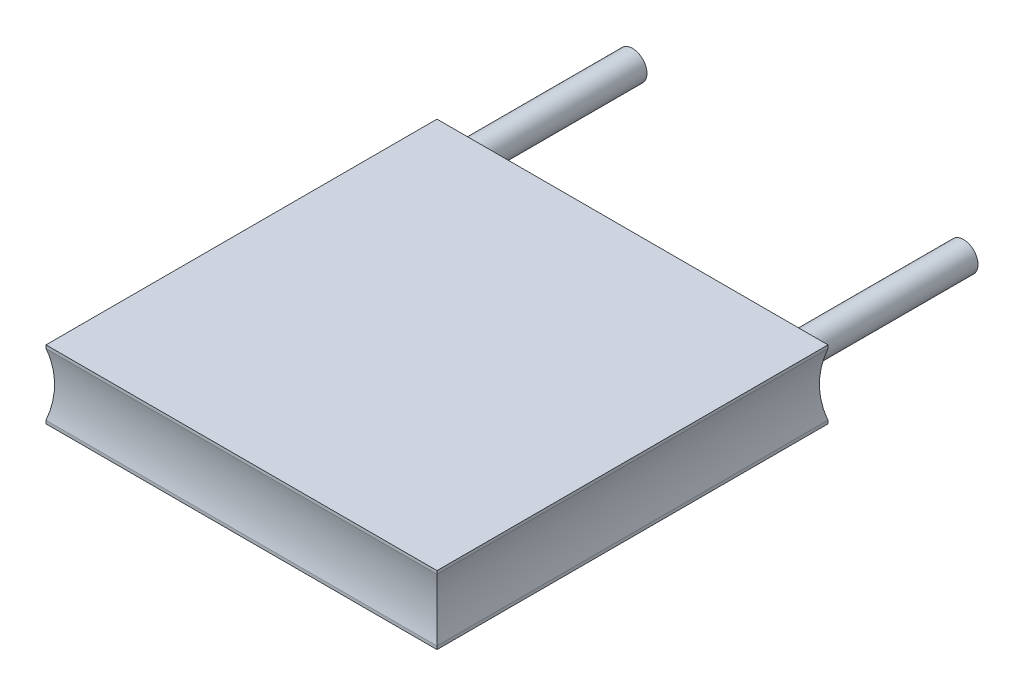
ISO-10303-21;
HEADER;
FILE_DESCRIPTION(('STEP AP214'),'2;1');
FILE_NAME('part.step','',(''),(''),'','','');
FILE_SCHEMA(('AUTOMOTIVE_DESIGN { 1 0 10303 214 1 1 1 1 }'));
ENDSEC;
DATA;
#1=APPLICATION_CONTEXT('core data for automotive mechanical design processes');
#2=APPLICATION_PROTOCOL_DEFINITION('international standard','automotive_design',2000,#1);
#3=PRODUCT_CONTEXT('',#1,'mechanical');
#4=PRODUCT('Part','Part','',(#3));
#5=PRODUCT_RELATED_PRODUCT_CATEGORY('part','',(#4));
#6=PRODUCT_DEFINITION_FORMATION('','',#4);
#7=PRODUCT_DEFINITION_CONTEXT('part definition',#1,'design');
#8=PRODUCT_DEFINITION('design','',#6,#7);
#9=PRODUCT_DEFINITION_SHAPE('','',#8);
#10=(LENGTH_UNIT() NAMED_UNIT(*) SI_UNIT(.MILLI.,.METRE.));
#11=(NAMED_UNIT(*) PLANE_ANGLE_UNIT() SI_UNIT($,.RADIAN.));
#12=(NAMED_UNIT(*) SI_UNIT($,.STERADIAN.) SOLID_ANGLE_UNIT());
#13=UNCERTAINTY_MEASURE_WITH_UNIT(LENGTH_MEASURE(1.E-05),#10,'distance_accuracy_value','');
#14=(GEOMETRIC_REPRESENTATION_CONTEXT(3) GLOBAL_UNCERTAINTY_ASSIGNED_CONTEXT((#13)) GLOBAL_UNIT_ASSIGNED_CONTEXT((#10,
#11,#12)) REPRESENTATION_CONTEXT('',''));
#15=CARTESIAN_POINT('',(0.,0.,0.));
#16=DIRECTION('',(0.,0.,1.));
#17=DIRECTION('',(1.,0.,0.));
#18=AXIS2_PLACEMENT_3D('',#15,#16,#17);
#19=CARTESIAN_POINT('',(-12.7,1.016,-27.7));
#20=DIRECTION('',(0.,0.,1.));
#21=DIRECTION('',(1.,0.,0.));
#22=AXIS2_PLACEMENT_3D('',#19,#20,#21);
#23=CYLINDRICAL_SURFACE('',#22,1.11125);
#24=CARTESIAN_POINT('',(-12.7,1.016,-27.7));
#25=DIRECTION('',(0.,0.,-1.));
#26=DIRECTION('',(-1.,0.,0.));
#27=AXIS2_PLACEMENT_3D('',#24,#25,#26);
#28=CIRCLE('',#27,1.11125);
#29=CARTESIAN_POINT('',(-13.81125,1.016,-27.7));
#30=VERTEX_POINT('',#29);
#31=EDGE_CURVE('E11',#30,#30,#28,.T.);
#32=ORIENTED_EDGE('',*,*,#31,.F.);
#33=EDGE_LOOP('',(#32));
#34=FACE_BOUND('',#33,.T.);
#35=CARTESIAN_POINT('',(-12.7,1.016,-15.));
#36=DIRECTION('',(0.,0.,-1.));
#37=DIRECTION('',(-1.,0.,0.));
#38=AXIS2_PLACEMENT_3D('',#35,#36,#37);
#39=CIRCLE('',#38,1.11125);
#40=CARTESIAN_POINT('',(-13.81125,1.016,-15.));
#41=VERTEX_POINT('',#40);
#42=EDGE_CURVE('E45',#41,#41,#39,.T.);
#43=ORIENTED_EDGE('',*,*,#42,.T.);
#44=EDGE_LOOP('',(#43));
#45=FACE_BOUND('',#44,.T.);
#46=ADVANCED_FACE('F42',(#34,#45),#23,.T.);
#47=CARTESIAN_POINT('',(-12.7,1.016,-27.7));
#48=DIRECTION('',(0.,0.,-1.));
#49=DIRECTION('',(-1.,0.,0.));
#50=AXIS2_PLACEMENT_3D('',#47,#48,#49);
#51=PLANE('',#50);
#52=ORIENTED_EDGE('',*,*,#31,.T.);
#53=EDGE_LOOP('',(#52));
#54=FACE_BOUND('',#53,.T.);
#55=ADVANCED_FACE('F57',(#54),#51,.T.);
#56=CARTESIAN_POINT('',(-12.7,1.016,-15.));
#57=DIRECTION('',(0.,0.,-1.));
#58=DIRECTION('',(-1.,0.,0.));
#59=AXIS2_PLACEMENT_3D('',#56,#57,#58);
#60=PLANE('',#59);
#61=ORIENTED_EDGE('',*,*,#42,.F.);
#62=EDGE_LOOP('',(#61));
#63=FACE_BOUND('',#62,.T.);
#64=ADVANCED_FACE('F55',(#63),#60,.F.);
#65=CLOSED_SHELL('',(#46,#55,#64));
#66=MANIFOLD_SOLID_BREP('B2',#65);
#67=CARTESIAN_POINT('',(12.7,1.016,-27.7));
#68=DIRECTION('',(0.,0.,1.));
#69=DIRECTION('',(1.,0.,0.));
#70=AXIS2_PLACEMENT_3D('',#67,#68,#69);
#71=CYLINDRICAL_SURFACE('',#70,1.11125);
#72=CARTESIAN_POINT('',(12.7,1.016,-27.7));
#73=DIRECTION('',(0.,0.,-1.));
#74=DIRECTION('',(-1.,0.,0.));
#75=AXIS2_PLACEMENT_3D('',#72,#73,#74);
#76=CIRCLE('',#75,1.11125);
#77=CARTESIAN_POINT('',(11.58875,1.016,-27.7));
#78=VERTEX_POINT('',#77);
#79=EDGE_CURVE('E41',#78,#78,#76,.T.);
#80=ORIENTED_EDGE('',*,*,#79,.F.);
#81=EDGE_LOOP('',(#80));
#82=FACE_BOUND('',#81,.T.);
#83=CARTESIAN_POINT('',(12.7,1.016,-15.));
#84=DIRECTION('',(0.,0.,-1.));
#85=DIRECTION('',(-1.,0.,0.));
#86=AXIS2_PLACEMENT_3D('',#83,#84,#85);
#87=CIRCLE('',#86,1.11125);
#88=CARTESIAN_POINT('',(11.58875,1.016,-15.));
#89=VERTEX_POINT('',#88);
#90=EDGE_CURVE('E99',#89,#89,#87,.T.);
#91=ORIENTED_EDGE('',*,*,#90,.T.);
#92=EDGE_LOOP('',(#91));
#93=FACE_BOUND('',#92,.T.);
#94=ADVANCED_FACE('F96',(#82,#93),#71,.T.);
#95=CARTESIAN_POINT('',(12.7,1.016,-27.7));
#96=DIRECTION('',(0.,0.,-1.));
#97=DIRECTION('',(-1.,0.,0.));
#98=AXIS2_PLACEMENT_3D('',#95,#96,#97);
#99=PLANE('',#98);
#100=ORIENTED_EDGE('',*,*,#79,.T.);
#101=EDGE_LOOP('',(#100));
#102=FACE_BOUND('',#101,.T.);
#103=ADVANCED_FACE('F111',(#102),#99,.T.);
#104=CARTESIAN_POINT('',(12.7,1.016,-15.));
#105=DIRECTION('',(0.,0.,-1.));
#106=DIRECTION('',(-1.,0.,0.));
#107=AXIS2_PLACEMENT_3D('',#104,#105,#106);
#108=PLANE('',#107);
#109=ORIENTED_EDGE('',*,*,#90,.F.);
#110=EDGE_LOOP('',(#109));
#111=FACE_BOUND('',#110,.T.);
#112=ADVANCED_FACE('F109',(#111),#108,.F.);
#113=CLOSED_SHELL('',(#94,#103,#112));
#114=MANIFOLD_SOLID_BREP('B6',#113);
#115=CARTESIAN_POINT('',(-15.,2.625,15.));
#116=DIRECTION('',(0.,0.,-1.));
#117=DIRECTION('',(-1.,0.,0.));
#118=AXIS2_PLACEMENT_3D('',#115,#116,#117);
#119=PLANE('',#118);
#120=DIRECTION('',(0.,-1.,0.));
#121=VECTOR('',#120,1.);
#122=CARTESIAN_POINT('',(15.,2.625,15.));
#123=LINE('',#122,#121);
#124=CARTESIAN_POINT('',(15.,-2.38125,15.));
#125=VERTEX_POINT('',#124);
#126=CARTESIAN_POINT('',(15.,-2.625,15.));
#127=VERTEX_POINT('',#126);
#128=EDGE_CURVE('E184',#125,#127,#123,.T.);
#129=ORIENTED_EDGE('',*,*,#128,.F.);
#130=DIRECTION('',(-1.,0.,0.));
#131=VECTOR('',#130,1.);
#132=CARTESIAN_POINT('',(15.,-2.38125000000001,15.));
#133=LINE('',#132,#131);
#134=CARTESIAN_POINT('',(-15.,-2.38125000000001,15.));
#135=VERTEX_POINT('',#134);
#136=EDGE_CURVE('E220',#125,#135,#133,.T.);
#137=ORIENTED_EDGE('',*,*,#136,.T.);
#138=DIRECTION('',(0.,-1.,0.));
#139=VECTOR('',#138,1.);
#140=CARTESIAN_POINT('',(-15.,2.625,15.));
#141=LINE('',#140,#139);
#142=CARTESIAN_POINT('',(-15.,-2.625,15.));
#143=VERTEX_POINT('',#142);
#144=EDGE_CURVE('E176',#135,#143,#141,.T.);
#145=ORIENTED_EDGE('',*,*,#144,.T.);
#146=DIRECTION('',(1.,0.,0.));
#147=VECTOR('',#146,1.);
#148=CARTESIAN_POINT('',(-15.,-2.625,15.));
#149=LINE('',#148,#147);
#150=EDGE_CURVE('E247',#143,#127,#149,.T.);
#151=ORIENTED_EDGE('',*,*,#150,.T.);
#152=EDGE_LOOP('',(#129,#137,#145,#151));
#153=FACE_BOUND('',#152,.T.);
#154=ADVANCED_FACE('F141',(#153),#119,.F.);
#155=CARTESIAN_POINT('',(-15.,2.625,-15.));
#156=DIRECTION('',(0.,0.,1.));
#157=DIRECTION('',(1.,0.,0.));
#158=AXIS2_PLACEMENT_3D('',#155,#156,#157);
#159=PLANE('',#158);
#160=DIRECTION('',(0.,-1.,0.));
#161=VECTOR('',#160,1.);
#162=CARTESIAN_POINT('',(15.,2.625,-15.));
#163=LINE('',#162,#161);
#164=CARTESIAN_POINT('',(15.,2.625,-15.));
#165=VERTEX_POINT('',#164);
#166=CARTESIAN_POINT('',(15.,2.38125,-15.));
#167=VERTEX_POINT('',#166);
#168=EDGE_CURVE('E255',#165,#167,#163,.T.);
#169=ORIENTED_EDGE('',*,*,#168,.T.);
#170=DIRECTION('',(-1.,0.,0.));
#171=VECTOR('',#170,1.);
#172=CARTESIAN_POINT('',(15.,2.38125,-15.));
#173=LINE('',#172,#171);
#174=CARTESIAN_POINT('',(-15.,2.38125,-15.));
#175=VERTEX_POINT('',#174);
#176=EDGE_CURVE('E297',#167,#175,#173,.T.);
#177=ORIENTED_EDGE('',*,*,#176,.T.);
#178=DIRECTION('',(0.,-1.,0.));
#179=VECTOR('',#178,1.);
#180=CARTESIAN_POINT('',(-15.,2.625,-15.));
#181=LINE('',#180,#179);
#182=CARTESIAN_POINT('',(-15.,2.625,-15.));
#183=VERTEX_POINT('',#182);
#184=EDGE_CURVE('E251',#183,#175,#181,.T.);
#185=ORIENTED_EDGE('',*,*,#184,.F.);
#186=DIRECTION('',(-1.,0.,0.));
#187=VECTOR('',#186,1.);
#188=CARTESIAN_POINT('',(-15.,2.625,-15.));
#189=LINE('',#188,#187);
#190=EDGE_CURVE('E191',#165,#183,#189,.T.);
#191=ORIENTED_EDGE('',*,*,#190,.F.);
#192=EDGE_LOOP('',(#169,#177,#185,#191));
#193=FACE_BOUND('',#192,.T.);
#194=ADVANCED_FACE('F305',(#193),#159,.F.);
#195=CARTESIAN_POINT('',(15.,2.625,15.));
#196=DIRECTION('',(-1.,0.,0.));
#197=DIRECTION('',(0.,0.,1.));
#198=AXIS2_PLACEMENT_3D('',#195,#196,#197);
#199=PLANE('',#198);
#200=CARTESIAN_POINT('',(15.,-2.38125,-15.));
#201=VERTEX_POINT('',#200);
#202=CARTESIAN_POINT('',(15.,-2.625,-15.));
#203=VERTEX_POINT('',#202);
#204=EDGE_CURVE('E254',#201,#203,#163,.T.);
#205=ORIENTED_EDGE('',*,*,#204,.F.);
#206=DIRECTION('',(0.,0.,1.));
#207=VECTOR('',#206,1.);
#208=CARTESIAN_POINT('',(15.,-2.38125,-15.));
#209=LINE('',#208,#207);
#210=EDGE_CURVE('E240',#201,#125,#209,.T.);
#211=ORIENTED_EDGE('',*,*,#210,.T.);
#212=ORIENTED_EDGE('',*,*,#128,.T.);
#213=DIRECTION('',(0.,0.,-1.));
#214=VECTOR('',#213,1.);
#215=CARTESIAN_POINT('',(15.,-2.625,15.));
#216=LINE('',#215,#214);
#217=EDGE_CURVE('E271',#127,#203,#216,.T.);
#218=ORIENTED_EDGE('',*,*,#217,.T.);
#219=EDGE_LOOP('',(#205,#211,#212,#218));
#220=FACE_BOUND('',#219,.T.);
#221=ADVANCED_FACE('F274',(#220),#199,.F.);
#222=CARTESIAN_POINT('',(-15.,2.625,15.));
#223=DIRECTION('',(1.,0.,0.));
#224=DIRECTION('',(0.,0.,-1.));
#225=AXIS2_PLACEMENT_3D('',#222,#223,#224);
#226=PLANE('',#225);
#227=ORIENTED_EDGE('',*,*,#184,.T.);
#228=DIRECTION('',(0.,0.,1.));
#229=VECTOR('',#228,1.);
#230=CARTESIAN_POINT('',(-15.,2.38125,-15.));
#231=LINE('',#230,#229);
#232=CARTESIAN_POINT('',(-15.,2.38125,15.));
#233=VERTEX_POINT('',#232);
#234=EDGE_CURVE('E275',#175,#233,#231,.T.);
#235=ORIENTED_EDGE('',*,*,#234,.T.);
#236=CARTESIAN_POINT('',(-15.,2.625,15.));
#237=VERTEX_POINT('',#236);
#238=EDGE_CURVE('E231',#237,#233,#141,.T.);
#239=ORIENTED_EDGE('',*,*,#238,.F.);
#240=DIRECTION('',(0.,0.,1.));
#241=VECTOR('',#240,1.);
#242=CARTESIAN_POINT('',(-15.,2.625,15.));
#243=LINE('',#242,#241);
#244=EDGE_CURVE('E284',#183,#237,#243,.T.);
#245=ORIENTED_EDGE('',*,*,#244,.F.);
#246=EDGE_LOOP('',(#227,#235,#239,#245));
#247=FACE_BOUND('',#246,.T.);
#248=ADVANCED_FACE('F290',(#247),#226,.F.);
#249=CARTESIAN_POINT('',(15.,2.625,15.));
#250=VERTEX_POINT('',#249);
#251=CARTESIAN_POINT('',(15.,2.38125,15.));
#252=VERTEX_POINT('',#251);
#253=EDGE_CURVE('E228',#250,#252,#123,.T.);
#254=ORIENTED_EDGE('',*,*,#253,.T.);
#255=DIRECTION('',(0.,0.,1.));
#256=VECTOR('',#255,1.);
#257=CARTESIAN_POINT('',(15.,2.38125,-15.));
#258=LINE('',#257,#256);
#259=EDGE_CURVE('E236',#167,#252,#258,.T.);
#260=ORIENTED_EDGE('',*,*,#259,.F.);
#261=ORIENTED_EDGE('',*,*,#168,.F.);
#262=DIRECTION('',(0.,0.,-1.));
#263=VECTOR('',#262,1.);
#264=CARTESIAN_POINT('',(15.,2.625,15.));
#265=LINE('',#264,#263);
#266=EDGE_CURVE('E243',#250,#165,#265,.T.);
#267=ORIENTED_EDGE('',*,*,#266,.F.);
#268=EDGE_LOOP('',(#254,#260,#261,#267));
#269=FACE_BOUND('',#268,.T.);
#270=ADVANCED_FACE('F143',(#269),#199,.F.);
#271=CARTESIAN_POINT('',(-15.,-2.38125,-15.));
#272=VERTEX_POINT('',#271);
#273=CARTESIAN_POINT('',(-15.,-2.625,-15.));
#274=VERTEX_POINT('',#273);
#275=EDGE_CURVE('E250',#272,#274,#181,.T.);
#276=ORIENTED_EDGE('',*,*,#275,.F.);
#277=DIRECTION('',(-1.,0.,0.));
#278=VECTOR('',#277,1.);
#279=CARTESIAN_POINT('',(15.,-2.38125,-15.));
#280=LINE('',#279,#278);
#281=EDGE_CURVE('E266',#201,#272,#280,.T.);
#282=ORIENTED_EDGE('',*,*,#281,.F.);
#283=ORIENTED_EDGE('',*,*,#204,.T.);
#284=DIRECTION('',(-1.,0.,0.));
#285=VECTOR('',#284,1.);
#286=CARTESIAN_POINT('',(-15.,-2.625,-15.));
#287=LINE('',#286,#285);
#288=EDGE_CURVE('E264',#203,#274,#287,.T.);
#289=ORIENTED_EDGE('',*,*,#288,.T.);
#290=EDGE_LOOP('',(#276,#282,#283,#289));
#291=FACE_BOUND('',#290,.T.);
#292=ADVANCED_FACE('F263',(#291),#159,.F.);
#293=ORIENTED_EDGE('',*,*,#144,.F.);
#294=DIRECTION('',(0.,0.,1.));
#295=VECTOR('',#294,1.);
#296=CARTESIAN_POINT('',(-15.,-2.38125,-15.));
#297=LINE('',#296,#295);
#298=EDGE_CURVE('E278',#272,#135,#297,.T.);
#299=ORIENTED_EDGE('',*,*,#298,.F.);
#300=ORIENTED_EDGE('',*,*,#275,.T.);
#301=DIRECTION('',(0.,0.,1.));
#302=VECTOR('',#301,1.);
#303=CARTESIAN_POINT('',(-15.,-2.625,15.));
#304=LINE('',#303,#302);
#305=EDGE_CURVE('E272',#274,#143,#304,.T.);
#306=ORIENTED_EDGE('',*,*,#305,.T.);
#307=EDGE_LOOP('',(#293,#299,#300,#306));
#308=FACE_BOUND('',#307,.T.);
#309=ADVANCED_FACE('F313',(#308),#226,.F.);
#310=ORIENTED_EDGE('',*,*,#238,.T.);
#311=DIRECTION('',(-1.,0.,0.));
#312=VECTOR('',#311,1.);
#313=CARTESIAN_POINT('',(15.,2.38125,15.));
#314=LINE('',#313,#312);
#315=EDGE_CURVE('E218',#252,#233,#314,.T.);
#316=ORIENTED_EDGE('',*,*,#315,.F.);
#317=ORIENTED_EDGE('',*,*,#253,.F.);
#318=DIRECTION('',(1.,0.,0.));
#319=VECTOR('',#318,1.);
#320=CARTESIAN_POINT('',(-15.,2.625,15.));
#321=LINE('',#320,#319);
#322=EDGE_CURVE('E158',#237,#250,#321,.T.);
#323=ORIENTED_EDGE('',*,*,#322,.F.);
#324=EDGE_LOOP('',(#310,#316,#317,#323));
#325=FACE_BOUND('',#324,.T.);
#326=ADVANCED_FACE('F226',(#325),#119,.F.);
#327=CARTESIAN_POINT('',(0.,2.625,0.));
#328=DIRECTION('',(0.,-1.,0.));
#329=DIRECTION('',(0.,0.,-1.));
#330=AXIS2_PLACEMENT_3D('',#327,#328,#329);
#331=PLANE('',#330);
#332=ORIENTED_EDGE('',*,*,#266,.T.);
#333=ORIENTED_EDGE('',*,*,#190,.T.);
#334=ORIENTED_EDGE('',*,*,#244,.T.);
#335=ORIENTED_EDGE('',*,*,#322,.T.);
#336=EDGE_LOOP('',(#332,#333,#334,#335));
#337=FACE_BOUND('',#336,.T.);
#338=ADVANCED_FACE('F288',(#337),#331,.F.);
#339=CARTESIAN_POINT('',(0.,-2.625,0.));
#340=DIRECTION('',(0.,-1.,0.));
#341=DIRECTION('',(0.,0.,-1.));
#342=AXIS2_PLACEMENT_3D('',#339,#340,#341);
#343=PLANE('',#342);
#344=ORIENTED_EDGE('',*,*,#217,.F.);
#345=ORIENTED_EDGE('',*,*,#150,.F.);
#346=ORIENTED_EDGE('',*,*,#305,.F.);
#347=ORIENTED_EDGE('',*,*,#288,.F.);
#348=EDGE_LOOP('',(#344,#345,#346,#347));
#349=FACE_BOUND('',#348,.T.);
#350=ADVANCED_FACE('F269',(#349),#343,.T.);
#351=CARTESIAN_POINT('',(-23.4211379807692,0.,-15.));
#352=DIRECTION('',(0.,0.,1.));
#353=DIRECTION('',(1.,0.,0.));
#354=AXIS2_PLACEMENT_3D('',#351,#352,#353);
#355=CYLINDRICAL_SURFACE('',#354,8.75133798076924);
#356=ORIENTED_EDGE('',*,*,#298,.T.);
#357=CARTESIAN_POINT('',(-23.4211379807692,0.,23.4211379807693));
#358=DIRECTION('',(0.707106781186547,0.,0.707106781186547));
#359=DIRECTION('',(-0.707106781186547,0.,0.707106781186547));
#360=AXIS2_PLACEMENT_3D('',#357,#358,#359);
#361=ELLIPSE('',#360,12.3762608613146,8.75133798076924);
#362=EDGE_CURVE('E232',#135,#233,#361,.T.);
#363=ORIENTED_EDGE('',*,*,#362,.T.);
#364=ORIENTED_EDGE('',*,*,#234,.F.);
#365=CARTESIAN_POINT('',(-23.4211379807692,0.,-23.4211379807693));
#366=DIRECTION('',(-0.707106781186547,0.,0.707106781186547));
#367=DIRECTION('',(0.707106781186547,0.,0.707106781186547));
#368=AXIS2_PLACEMENT_3D('',#365,#366,#367);
#369=ELLIPSE('',#368,12.3762608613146,8.75133798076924);
#370=EDGE_CURVE('E241',#175,#272,#369,.F.);
#371=ORIENTED_EDGE('',*,*,#370,.T.);
#372=EDGE_LOOP('',(#356,#363,#364,#371));
#373=FACE_BOUND('',#372,.T.);
#374=ADVANCED_FACE('F295',(#373),#355,.F.);
#375=CARTESIAN_POINT('',(23.4211379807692,0.,-15.));
#376=DIRECTION('',(0.,0.,1.));
#377=DIRECTION('',(1.,0.,0.));
#378=AXIS2_PLACEMENT_3D('',#375,#376,#377);
#379=CYLINDRICAL_SURFACE('',#378,8.75133798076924);
#380=ORIENTED_EDGE('',*,*,#259,.T.);
#381=CARTESIAN_POINT('',(23.4211379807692,0.,23.4211379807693));
#382=DIRECTION('',(-0.707106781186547,0.,0.707106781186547));
#383=DIRECTION('',(0.707106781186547,0.,0.707106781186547));
#384=AXIS2_PLACEMENT_3D('',#381,#382,#383);
#385=ELLIPSE('',#384,12.3762608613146,8.75133798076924);
#386=EDGE_CURVE('E94',#252,#125,#385,.T.);
#387=ORIENTED_EDGE('',*,*,#386,.T.);
#388=ORIENTED_EDGE('',*,*,#210,.F.);
#389=CARTESIAN_POINT('',(23.4211379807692,0.,-23.4211379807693));
#390=DIRECTION('',(0.707106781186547,0.,0.707106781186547));
#391=DIRECTION('',(-0.707106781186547,0.,0.707106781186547));
#392=AXIS2_PLACEMENT_3D('',#389,#390,#391);
#393=ELLIPSE('',#392,12.3762608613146,8.75133798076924);
#394=EDGE_CURVE('E150',#201,#167,#393,.F.);
#395=ORIENTED_EDGE('',*,*,#394,.T.);
#396=EDGE_LOOP('',(#380,#387,#388,#395));
#397=FACE_BOUND('',#396,.T.);
#398=ADVANCED_FACE('F237',(#397),#379,.F.);
#399=CARTESIAN_POINT('',(15.,0.,-23.4211379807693));
#400=DIRECTION('',(-1.,0.,0.));
#401=DIRECTION('',(0.,0.,1.));
#402=AXIS2_PLACEMENT_3D('',#399,#400,#401);
#403=CYLINDRICAL_SURFACE('',#402,8.75133798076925);
#404=ORIENTED_EDGE('',*,*,#176,.F.);
#405=ORIENTED_EDGE('',*,*,#394,.F.);
#406=ORIENTED_EDGE('',*,*,#281,.T.);
#407=ORIENTED_EDGE('',*,*,#370,.F.);
#408=EDGE_LOOP('',(#404,#405,#406,#407));
#409=FACE_BOUND('',#408,.T.);
#410=ADVANCED_FACE('F392',(#409),#403,.F.);
#411=CARTESIAN_POINT('',(15.,0.,23.4211379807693));
#412=DIRECTION('',(-1.,0.,0.));
#413=DIRECTION('',(0.,0.,1.));
#414=AXIS2_PLACEMENT_3D('',#411,#412,#413);
#415=CYLINDRICAL_SURFACE('',#414,8.75133798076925);
#416=ORIENTED_EDGE('',*,*,#136,.F.);
#417=ORIENTED_EDGE('',*,*,#386,.F.);
#418=ORIENTED_EDGE('',*,*,#315,.T.);
#419=ORIENTED_EDGE('',*,*,#362,.F.);
#420=EDGE_LOOP('',(#416,#417,#418,#419));
#421=FACE_BOUND('',#420,.T.);
#422=ADVANCED_FACE('F217',(#421),#415,.F.);
#423=CLOSED_SHELL('',(#154,#194,#221,#248,#270,#292,#309,#326,#338,#350,#374,#398,#410,#422));
#424=MANIFOLD_SOLID_BREP('B36',#423);
#425=ADVANCED_BREP_SHAPE_REPRESENTATION('',(#18,#66,#114,#424),#14);
#426=SHAPE_DEFINITION_REPRESENTATION(#9,#425);
ENDSEC;
END-ISO-10303-21;
